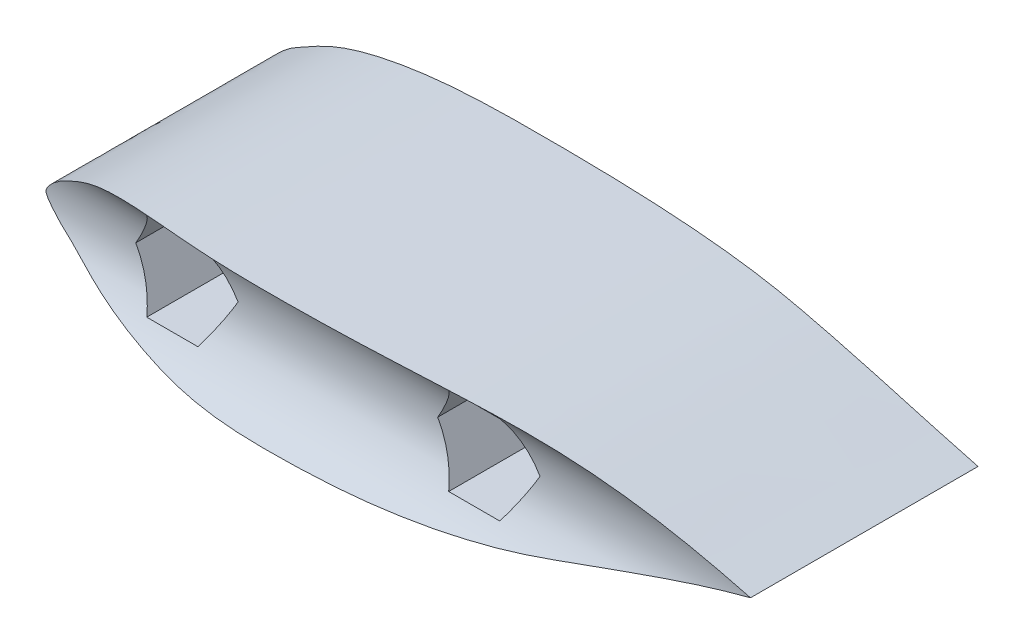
from build123d import *

# Parameters (mm, degrees)
BOSS_EXTRUDE1_DEPTH = 15
SKETCH2_R           = 3.7
CUT_EXTRUDE1_DEPTH  = 35
CUT_EXTRUDE2_DEPTH  = 13
SKETCH4_R           = 1.1
CUT_EXTRUDE3_DEPTH  = 23


with BuildPart() as part:
    # Sketch1 → Boss-Extrude1 (new body)
    with BuildSketch(Plane.XY):
        with BuildLine():
            add(Edge.make_bspline(
                [(0, 0), (0.007727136, 0.267032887), (0.797245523, 0.898720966), (1.409957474, 1.236149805), (3.069985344, 2.259200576), (7.565425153, 3.331084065), (13.362385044, 3.482891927), (22.290039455, 3.265274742), (29.293829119, 1.652129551), (32.234609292, 0.717869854), (35, 0)],
                knots=[0, 0, 0, 0, 0.022524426, 0.034643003, 0.121185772, 0.243771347, 0.472972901, 0.711145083, 0.763847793, 1, 1, 1, 1], degree=3))
            add(Edge.make_bspline(
                [(0, 0), (0.007727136, -0.267032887), (0.797245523, -0.898720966), (1.409957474, -1.236149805), (3.069985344, -2.259200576), (7.565425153, -3.331084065), (13.362385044, -3.482891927), (22.290039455, -3.265274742), (29.293829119, -1.652129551), (32.234609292, -0.717869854), (35, 0)],
                knots=[0, 0, 0, 0, 0.022524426, 0.034643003, 0.121185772, 0.243771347, 0.472972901, 0.711145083, 0.763847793, 1, 1, 1, 1], degree=3))
        make_face()
    extrude(amount=BOSS_EXTRUDE1_DEPTH)

    # Sketch2 → Cut-Extrude1 (cut)
    with BuildSketch(Plane(origin=(0, 0, 0), x_dir=(0, 0, -1), z_dir=(1, 0, 0))):
        with Locations((-15, 0)):
            Circle(SKETCH2_R)
    extrude(amount=CUT_EXTRUDE1_DEPTH, mode=Mode.SUBTRACT)

    # Sketch3 → Cut-Extrude2 (cut)
    with BuildSketch(Plane.XY.offset(15)):
        Polygon((9.540341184, 0), (8.270170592, 2.2), (5.729829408, 2.2), (4.459658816, 0), (5.729829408, -2.2), (8.270170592, -2.2), align=None)
        Polygon((23.270170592, -2.2), (24.540341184, 0), (23.270170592, 2.2), (20.729829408, 2.2), (19.459658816, 0), (20.729829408, -2.2), align=None)
    extrude(amount=-CUT_EXTRUDE2_DEPTH, mode=Mode.SUBTRACT)

    # Sketch4 → Cut-Extrude3 (cut)
    with BuildSketch(Plane.XY.offset(15)):
        with Locations((7, 0)):
            Circle(SKETCH4_R)
        with Locations((22, 0)):
            Circle(SKETCH4_R)
    extrude(amount=-CUT_EXTRUDE3_DEPTH, mode=Mode.SUBTRACT)


solid = part.part
